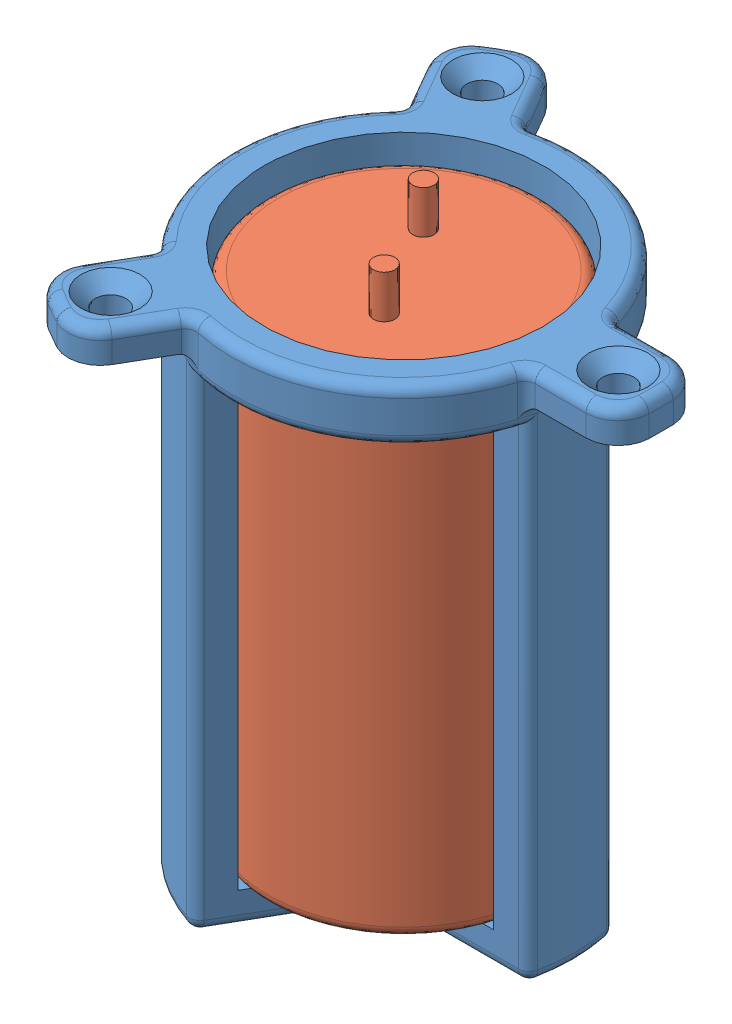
SolidWorks assembly Suporte com Capacitor.SLDASM, configuration Valor predeterminado (file format 13000). Lengths in mm.
Overall size (41.35 52 43.33).
2 component instances, 2 part files, 6 mates.
Components (placement in the parent):
- Suporte do Capacitor-1: Suporte do Capacitor.SLDPRT [Valor predeterminado] at (0 -50 0) x (0 0 1) z (-1 0 0) size (43.33 50 40)
- Mockup Capacitor-1: Mockup Capacitor.SLDPRT [Valor predeterminado] at (0 -47 0) x (0.5 0 0.866025) z (-0.866025 0 0.5) size (25.4 49 25.4)
Mates (geometry in assembly coordinates):
- Coincidente1: coincident: point of Suporte do Capacitor-1; point of assembly
- Coincidente2: coincident aligned: plane of Suporte do Capacitor-1 through (0 0 0) normal (0 1 0)
- Paralelo1: parallel aligned: plane of Suporte do Capacitor-1 through (15.4919 -47 4) normal (0 0 1)
- Concêntrico1: concentric aligned: cylinder of Suporte do Capacitor-1 through (0 -5 0) axis (0 -1 0) radius 13; cylinder of Mockup Capacitor-1 through (0 -2 0) axis (0 -1 0) radius 12.7
- Coincidente4: coincident anti-aligned: plane of Suporte do Capacitor-1 through (0 -47 0) normal (0 1 0); plane of Mockup Capacitor-1 through (0 -47 0) normal (0 -1 0)
- Paralelo2: parallel anti-aligned: line of Suporte do Capacitor-1 through (0 0 0) axis (-0.5 0 -0.866025); line of Mockup Capacitor-1 through (-5.85 -2 -10.1325) axis (0.5 0 0.866025)
